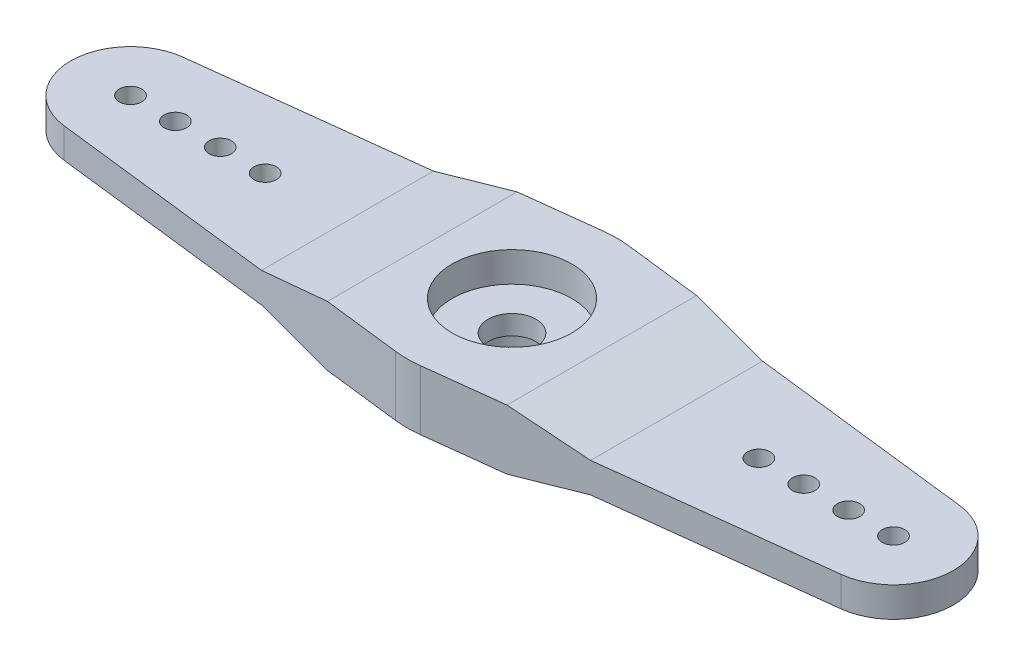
ISO-10303-21;
HEADER;
FILE_DESCRIPTION(('STEP AP214'),'2;1');
FILE_NAME('part.step','',(''),(''),'','','');
FILE_SCHEMA(('AUTOMOTIVE_DESIGN { 1 0 10303 214 1 1 1 1 }'));
ENDSEC;
DATA;
#1=APPLICATION_CONTEXT('core data for automotive mechanical design processes');
#2=APPLICATION_PROTOCOL_DEFINITION('international standard','automotive_design',2000,#1);
#3=PRODUCT_CONTEXT('',#1,'mechanical');
#4=PRODUCT('Part','Part','',(#3));
#5=PRODUCT_RELATED_PRODUCT_CATEGORY('part','',(#4));
#6=PRODUCT_DEFINITION_FORMATION('','',#4);
#7=PRODUCT_DEFINITION_CONTEXT('part definition',#1,'design');
#8=PRODUCT_DEFINITION('design','',#6,#7);
#9=PRODUCT_DEFINITION_SHAPE('','',#8);
#10=(LENGTH_UNIT() NAMED_UNIT(*) SI_UNIT(.MILLI.,.METRE.));
#11=(NAMED_UNIT(*) PLANE_ANGLE_UNIT() SI_UNIT($,.RADIAN.));
#12=(NAMED_UNIT(*) SI_UNIT($,.STERADIAN.) SOLID_ANGLE_UNIT());
#13=UNCERTAINTY_MEASURE_WITH_UNIT(LENGTH_MEASURE(1.E-05),#10,'distance_accuracy_value','');
#14=(GEOMETRIC_REPRESENTATION_CONTEXT(3) GLOBAL_UNCERTAINTY_ASSIGNED_CONTEXT((#13)) GLOBAL_UNIT_ASSIGNED_CONTEXT((#10,
#11,#12)) REPRESENTATION_CONTEXT('',''));
#15=CARTESIAN_POINT('',(0.,0.,0.));
#16=DIRECTION('',(0.,0.,1.));
#17=DIRECTION('',(1.,0.,0.));
#18=AXIS2_PLACEMENT_3D('',#15,#16,#17);
#19=CARTESIAN_POINT('',(-6.,0.,30.));
#20=DIRECTION('',(0.,1.,0.));
#21=DIRECTION('',(0.,0.,1.));
#22=AXIS2_PLACEMENT_3D('',#19,#20,#21);
#23=PLANE('',#22);
#24=DIRECTION('',(-0.993055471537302,0.,0.117647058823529));
#25=VECTOR('',#24,1.);
#26=CARTESIAN_POINT('',(-25.9705882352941,0.,11.0277781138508));
#27=LINE('',#26,#25);
#28=CARTESIAN_POINT('',(-0.823529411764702,0.,8.04861169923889));
#29=VERTEX_POINT('',#28);
#30=CARTESIAN_POINT('',(-6.,0.,8.66186700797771));
#31=VERTEX_POINT('',#30);
#32=EDGE_CURVE('E182',#29,#31,#27,.T.);
#33=ORIENTED_EDGE('',*,*,#32,.F.);
#34=CARTESIAN_POINT('',(0.,0.,15.));
#35=DIRECTION('',(0.,1.,0.));
#36=DIRECTION('',(0.,0.,1.));
#37=AXIS2_PLACEMENT_3D('',#34,#35,#36);
#38=CIRCLE('',#37,7.);
#39=CARTESIAN_POINT('',(0.823529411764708,0.,8.04861169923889));
#40=VERTEX_POINT('',#39);
#41=EDGE_CURVE('E176',#40,#29,#38,.T.);
#42=ORIENTED_EDGE('',*,*,#41,.F.);
#43=DIRECTION('',(-0.993055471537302,0.,-0.117647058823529));
#44=VECTOR('',#43,1.);
#45=CARTESIAN_POINT('',(0.823529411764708,0.,8.04861169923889));
#46=LINE('',#45,#44);
#47=CARTESIAN_POINT('',(5.99999999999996,0.,8.66186700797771));
#48=VERTEX_POINT('',#47);
#49=EDGE_CURVE('E174',#48,#40,#46,.T.);
#50=ORIENTED_EDGE('',*,*,#49,.F.);
#51=DIRECTION('',(0.,0.,-1.));
#52=VECTOR('',#51,1.);
#53=CARTESIAN_POINT('',(6.,0.,30.));
#54=LINE('',#53,#52);
#55=CARTESIAN_POINT('',(6.00000000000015,0.,21.3381329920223));
#56=VERTEX_POINT('',#55);
#57=EDGE_CURVE('E173',#56,#48,#54,.T.);
#58=ORIENTED_EDGE('',*,*,#57,.F.);
#59=DIRECTION('',(0.993055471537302,0.,-0.117647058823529));
#60=VECTOR('',#59,1.);
#61=CARTESIAN_POINT('',(25.9705882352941,0.,18.9722218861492));
#62=LINE('',#61,#60);
#63=CARTESIAN_POINT('',(0.823529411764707,0.,21.9513883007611));
#64=VERTEX_POINT('',#63);
#65=EDGE_CURVE('E151',#64,#56,#62,.T.);
#66=ORIENTED_EDGE('',*,*,#65,.F.);
#67=CARTESIAN_POINT('',(0.,0.,15.));
#68=DIRECTION('',(0.,1.,0.));
#69=DIRECTION('',(0.,0.,1.));
#70=AXIS2_PLACEMENT_3D('',#67,#68,#69);
#71=CIRCLE('',#70,7.);
#72=CARTESIAN_POINT('',(-0.823529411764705,0.,21.9513883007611));
#73=VERTEX_POINT('',#72);
#74=EDGE_CURVE('E161',#73,#64,#71,.T.);
#75=ORIENTED_EDGE('',*,*,#74,.F.);
#76=DIRECTION('',(0.993055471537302,0.,0.117647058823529));
#77=VECTOR('',#76,1.);
#78=CARTESIAN_POINT('',(-0.823529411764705,0.,21.9513883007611));
#79=LINE('',#78,#77);
#80=CARTESIAN_POINT('',(-6.,0.,21.3381329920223));
#81=VERTEX_POINT('',#80);
#82=EDGE_CURVE('E157',#81,#73,#79,.T.);
#83=ORIENTED_EDGE('',*,*,#82,.F.);
#84=DIRECTION('',(0.,0.,-1.));
#85=VECTOR('',#84,1.);
#86=CARTESIAN_POINT('',(-6.,0.,30.));
#87=LINE('',#86,#85);
#88=EDGE_CURVE('E263',#81,#31,#87,.T.);
#89=ORIENTED_EDGE('',*,*,#88,.T.);
#90=EDGE_LOOP('',(#33,#42,#50,#58,#66,#75,#83,#89));
#91=FACE_BOUND('',#90,.T.);
#92=CARTESIAN_POINT('',(0.,0.,15.));
#93=DIRECTION('',(0.,1.,0.));
#94=DIRECTION('',(0.,0.,1.));
#95=AXIS2_PLACEMENT_3D('',#92,#93,#94);
#96=CIRCLE('',#95,5.);
#97=CARTESIAN_POINT('',(0.,0.,20.));
#98=VERTEX_POINT('',#97);
#99=EDGE_CURVE('E11',#98,#98,#96,.F.);
#100=ORIENTED_EDGE('',*,*,#99,.F.);
#101=EDGE_LOOP('',(#100));
#102=FACE_BOUND('',#101,.T.);
#103=ADVANCED_FACE('F35',(#91,#102),#23,.F.);
#104=CARTESIAN_POINT('',(-30.,3.,30.));
#105=DIRECTION('',(0.,-1.,0.));
#106=DIRECTION('',(0.,0.,-1.));
#107=AXIS2_PLACEMENT_3D('',#104,#105,#106);
#108=PLANE('',#107);
#109=CARTESIAN_POINT('',(-25.5,3.,15.));
#110=DIRECTION('',(0.,1.,0.));
#111=DIRECTION('',(0.,0.,1.));
#112=AXIS2_PLACEMENT_3D('',#109,#110,#111);
#113=CIRCLE('',#112,0.750000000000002);
#114=CARTESIAN_POINT('',(-25.5,3.,15.75));
#115=VERTEX_POINT('',#114);
#116=EDGE_CURVE('E291',#115,#115,#113,.T.);
#117=ORIENTED_EDGE('',*,*,#116,.F.);
#118=EDGE_LOOP('',(#117));
#119=FACE_BOUND('',#118,.T.);
#120=CARTESIAN_POINT('',(-22.5,3.,15.));
#121=DIRECTION('',(0.,1.,0.));
#122=DIRECTION('',(0.,0.,1.));
#123=AXIS2_PLACEMENT_3D('',#120,#121,#122);
#124=CIRCLE('',#123,0.750000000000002);
#125=CARTESIAN_POINT('',(-22.5,3.,15.75));
#126=VERTEX_POINT('',#125);
#127=EDGE_CURVE('E287',#126,#126,#124,.T.);
#128=ORIENTED_EDGE('',*,*,#127,.F.);
#129=EDGE_LOOP('',(#128));
#130=FACE_BOUND('',#129,.T.);
#131=CARTESIAN_POINT('',(-19.5,3.,15.));
#132=DIRECTION('',(0.,1.,0.));
#133=DIRECTION('',(0.,0.,1.));
#134=AXIS2_PLACEMENT_3D('',#131,#132,#133);
#135=CIRCLE('',#134,0.750000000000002);
#136=CARTESIAN_POINT('',(-19.5,3.,15.75));
#137=VERTEX_POINT('',#136);
#138=EDGE_CURVE('E283',#137,#137,#135,.T.);
#139=ORIENTED_EDGE('',*,*,#138,.F.);
#140=EDGE_LOOP('',(#139));
#141=FACE_BOUND('',#140,.T.);
#142=CARTESIAN_POINT('',(-16.5,3.,15.));
#143=DIRECTION('',(0.,1.,0.));
#144=DIRECTION('',(0.,0.,1.));
#145=AXIS2_PLACEMENT_3D('',#142,#143,#144);
#146=CIRCLE('',#145,0.750000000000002);
#147=CARTESIAN_POINT('',(-16.5,3.,15.75));
#148=VERTEX_POINT('',#147);
#149=EDGE_CURVE('E279',#148,#148,#146,.T.);
#150=ORIENTED_EDGE('',*,*,#149,.F.);
#151=EDGE_LOOP('',(#150));
#152=FACE_BOUND('',#151,.T.);
#153=DIRECTION('',(-0.993055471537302,0.,-0.117647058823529));
#154=VECTOR('',#153,1.);
#155=CARTESIAN_POINT('',(-28.6558536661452,3.,18.6540990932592));
#156=LINE('',#155,#154);
#157=CARTESIAN_POINT('',(-11.,3.,20.7457841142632));
#158=VERTEX_POINT('',#157);
#159=CARTESIAN_POINT('',(-25.9705882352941,3.,18.9722218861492));
#160=VERTEX_POINT('',#159);
#161=EDGE_CURVE('E242',#158,#160,#156,.T.);
#162=ORIENTED_EDGE('',*,*,#161,.F.);
#163=DIRECTION('',(0.,0.,-1.));
#164=VECTOR('',#163,1.);
#165=CARTESIAN_POINT('',(-11.,3.,30.));
#166=LINE('',#165,#164);
#167=CARTESIAN_POINT('',(-11.,3.,9.2542158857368));
#168=VERTEX_POINT('',#167);
#169=EDGE_CURVE('E269',#158,#168,#166,.T.);
#170=ORIENTED_EDGE('',*,*,#169,.T.);
#171=DIRECTION('',(0.993055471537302,0.,-0.117647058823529));
#172=VECTOR('',#171,1.);
#173=CARTESIAN_POINT('',(-32.1607553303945,3.,11.7611258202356));
#174=LINE('',#173,#172);
#175=CARTESIAN_POINT('',(-25.9705882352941,3.,11.0277781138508));
#176=VERTEX_POINT('',#175);
#177=EDGE_CURVE('E234',#176,#168,#174,.T.);
#178=ORIENTED_EDGE('',*,*,#177,.F.);
#179=CARTESIAN_POINT('',(-25.5,3.,15.));
#180=DIRECTION('',(0.,-1.,0.));
#181=DIRECTION('',(0.,0.,-1.));
#182=AXIS2_PLACEMENT_3D('',#179,#180,#181);
#183=CIRCLE('',#182,4.);
#184=EDGE_CURVE('E248',#160,#176,#183,.T.);
#185=ORIENTED_EDGE('',*,*,#184,.F.);
#186=EDGE_LOOP('',(#162,#170,#178,#185));
#187=FACE_BOUND('',#186,.T.);
#188=ADVANCED_FACE('F348',(#119,#130,#141,#152,#187),#108,.F.);
#189=CARTESIAN_POINT('',(-6.,4.,30.));
#190=DIRECTION('',(0.,-1.,0.));
#191=DIRECTION('',(0.,0.,-1.));
#192=AXIS2_PLACEMENT_3D('',#189,#190,#191);
#193=PLANE('',#192);
#194=CARTESIAN_POINT('',(0.,4.,15.));
#195=DIRECTION('',(0.,1.,0.));
#196=DIRECTION('',(0.,0.,1.));
#197=AXIS2_PLACEMENT_3D('',#194,#195,#196);
#198=CIRCLE('',#197,4.);
#199=CARTESIAN_POINT('',(0.,4.,19.));
#200=VERTEX_POINT('',#199);
#201=EDGE_CURVE('E337',#200,#200,#198,.T.);
#202=ORIENTED_EDGE('',*,*,#201,.F.);
#203=EDGE_LOOP('',(#202));
#204=FACE_BOUND('',#203,.T.);
#205=DIRECTION('',(-0.993055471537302,0.,0.117647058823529));
#206=VECTOR('',#205,1.);
#207=CARTESIAN_POINT('',(-25.9705882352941,4.,11.0277781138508));
#208=LINE('',#207,#206);
#209=CARTESIAN_POINT('',(-0.823529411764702,4.,8.04861169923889));
#210=VERTEX_POINT('',#209);
#211=CARTESIAN_POINT('',(-6.,4.,8.66186700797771));
#212=VERTEX_POINT('',#211);
#213=EDGE_CURVE('E195',#210,#212,#208,.T.);
#214=ORIENTED_EDGE('',*,*,#213,.T.);
#215=DIRECTION('',(0.,0.,-1.));
#216=VECTOR('',#215,1.);
#217=CARTESIAN_POINT('',(-6.,4.,30.));
#218=LINE('',#217,#216);
#219=CARTESIAN_POINT('',(-6.,4.,21.3381329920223));
#220=VERTEX_POINT('',#219);
#221=EDGE_CURVE('E250',#220,#212,#218,.T.);
#222=ORIENTED_EDGE('',*,*,#221,.F.);
#223=DIRECTION('',(0.993055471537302,0.,0.117647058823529));
#224=VECTOR('',#223,1.);
#225=CARTESIAN_POINT('',(-0.823529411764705,4.,21.9513883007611));
#226=LINE('',#225,#224);
#227=CARTESIAN_POINT('',(-0.823529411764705,4.,21.9513883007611));
#228=VERTEX_POINT('',#227);
#229=EDGE_CURVE('E166',#220,#228,#226,.T.);
#230=ORIENTED_EDGE('',*,*,#229,.T.);
#231=CARTESIAN_POINT('',(0.,4.,15.));
#232=DIRECTION('',(0.,1.,0.));
#233=DIRECTION('',(0.,0.,1.));
#234=AXIS2_PLACEMENT_3D('',#231,#232,#233);
#235=CIRCLE('',#234,7.);
#236=CARTESIAN_POINT('',(0.823529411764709,4.,21.9513883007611));
#237=VERTEX_POINT('',#236);
#238=EDGE_CURVE('E185',#228,#237,#235,.T.);
#239=ORIENTED_EDGE('',*,*,#238,.T.);
#240=DIRECTION('',(0.993055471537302,0.,-0.117647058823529));
#241=VECTOR('',#240,1.);
#242=CARTESIAN_POINT('',(25.9705882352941,4.,18.9722218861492));
#243=LINE('',#242,#241);
#244=CARTESIAN_POINT('',(6.,4.,21.3381329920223));
#245=VERTEX_POINT('',#244);
#246=EDGE_CURVE('E152',#237,#245,#243,.T.);
#247=ORIENTED_EDGE('',*,*,#246,.T.);
#248=DIRECTION('',(0.,0.,-1.));
#249=VECTOR('',#248,1.);
#250=CARTESIAN_POINT('',(6.,4.,30.));
#251=LINE('',#250,#249);
#252=CARTESIAN_POINT('',(6.,4.,8.66186700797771));
#253=VERTEX_POINT('',#252);
#254=EDGE_CURVE('E253',#245,#253,#251,.T.);
#255=ORIENTED_EDGE('',*,*,#254,.T.);
#256=DIRECTION('',(-0.993055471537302,0.,-0.117647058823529));
#257=VECTOR('',#256,1.);
#258=CARTESIAN_POINT('',(0.823529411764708,4.,8.04861169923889));
#259=LINE('',#258,#257);
#260=CARTESIAN_POINT('',(0.823529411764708,4.,8.04861169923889));
#261=VERTEX_POINT('',#260);
#262=EDGE_CURVE('E189',#253,#261,#259,.T.);
#263=ORIENTED_EDGE('',*,*,#262,.T.);
#264=CARTESIAN_POINT('',(0.,4.,15.));
#265=DIRECTION('',(0.,1.,0.));
#266=DIRECTION('',(0.,0.,1.));
#267=AXIS2_PLACEMENT_3D('',#264,#265,#266);
#268=CIRCLE('',#267,7.);
#269=EDGE_CURVE('E192',#261,#210,#268,.T.);
#270=ORIENTED_EDGE('',*,*,#269,.T.);
#271=EDGE_LOOP('',(#214,#222,#230,#239,#247,#255,#263,#270));
#272=FACE_BOUND('',#271,.T.);
#273=ADVANCED_FACE('F344',(#204,#272),#193,.F.);
#274=CARTESIAN_POINT('',(6.,4.,30.));
#275=DIRECTION('',(-0.196116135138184,-0.98058067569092,0.));
#276=DIRECTION('',(0.98058067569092,-0.196116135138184,0.));
#277=AXIS2_PLACEMENT_3D('',#274,#275,#276);
#278=PLANE('',#277);
#279=DIRECTION('',(0.974030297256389,-0.194806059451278,0.115393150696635));
#280=VECTOR('',#279,1.);
#281=CARTESIAN_POINT('',(8.39832986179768,3.52033402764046,8.94599660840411));
#282=LINE('',#281,#280);
#283=CARTESIAN_POINT('',(11.,3.,9.25421588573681));
#284=VERTEX_POINT('',#283);
#285=EDGE_CURVE('E222',#253,#284,#282,.T.);
#286=ORIENTED_EDGE('',*,*,#285,.F.);
#287=ORIENTED_EDGE('',*,*,#254,.F.);
#288=DIRECTION('',(-0.974030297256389,0.194806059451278,0.115393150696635));
#289=VECTOR('',#288,1.);
#290=CARTESIAN_POINT('',(5.02643711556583,4.19471257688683,21.4534707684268));
#291=LINE('',#290,#289);
#292=CARTESIAN_POINT('',(11.,3.,20.7457841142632));
#293=VERTEX_POINT('',#292);
#294=EDGE_CURVE('E59',#293,#245,#291,.T.);
#295=ORIENTED_EDGE('',*,*,#294,.F.);
#296=DIRECTION('',(0.,0.,-1.));
#297=VECTOR('',#296,1.);
#298=CARTESIAN_POINT('',(11.,3.,30.));
#299=LINE('',#298,#297);
#300=EDGE_CURVE('E256',#293,#284,#299,.T.);
#301=ORIENTED_EDGE('',*,*,#300,.T.);
#302=EDGE_LOOP('',(#286,#287,#295,#301));
#303=FACE_BOUND('',#302,.T.);
#304=ADVANCED_FACE('F347',(#303),#278,.F.);
#305=CARTESIAN_POINT('',(11.,3.,30.));
#306=DIRECTION('',(0.,-1.,0.));
#307=DIRECTION('',(0.,0.,-1.));
#308=AXIS2_PLACEMENT_3D('',#305,#306,#307);
#309=PLANE('',#308);
#310=CARTESIAN_POINT('',(25.5,3.,15.));
#311=DIRECTION('',(0.,1.,0.));
#312=DIRECTION('',(0.,0.,1.));
#313=AXIS2_PLACEMENT_3D('',#310,#311,#312);
#314=CIRCLE('',#313,0.750000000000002);
#315=CARTESIAN_POINT('',(25.5,3.,15.75));
#316=VERTEX_POINT('',#315);
#317=EDGE_CURVE('E305',#316,#316,#314,.T.);
#318=ORIENTED_EDGE('',*,*,#317,.F.);
#319=EDGE_LOOP('',(#318));
#320=FACE_BOUND('',#319,.T.);
#321=CARTESIAN_POINT('',(22.5,3.,15.));
#322=DIRECTION('',(0.,1.,0.));
#323=DIRECTION('',(0.,0.,1.));
#324=AXIS2_PLACEMENT_3D('',#321,#322,#323);
#325=CIRCLE('',#324,0.750000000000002);
#326=CARTESIAN_POINT('',(22.5,3.,15.75));
#327=VERTEX_POINT('',#326);
#328=EDGE_CURVE('E302',#327,#327,#325,.T.);
#329=ORIENTED_EDGE('',*,*,#328,.F.);
#330=EDGE_LOOP('',(#329));
#331=FACE_BOUND('',#330,.T.);
#332=CARTESIAN_POINT('',(19.5,3.,15.));
#333=DIRECTION('',(0.,1.,0.));
#334=DIRECTION('',(0.,0.,1.));
#335=AXIS2_PLACEMENT_3D('',#332,#333,#334);
#336=CIRCLE('',#335,0.750000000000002);
#337=CARTESIAN_POINT('',(19.5,3.,15.75));
#338=VERTEX_POINT('',#337);
#339=EDGE_CURVE('E299',#338,#338,#336,.T.);
#340=ORIENTED_EDGE('',*,*,#339,.F.);
#341=EDGE_LOOP('',(#340));
#342=FACE_BOUND('',#341,.T.);
#343=CARTESIAN_POINT('',(16.5,3.,15.));
#344=DIRECTION('',(0.,1.,0.));
#345=DIRECTION('',(0.,0.,1.));
#346=AXIS2_PLACEMENT_3D('',#343,#344,#345);
#347=CIRCLE('',#346,0.750000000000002);
#348=CARTESIAN_POINT('',(16.5,3.,15.75));
#349=VERTEX_POINT('',#348);
#350=EDGE_CURVE('E295',#349,#349,#347,.T.);
#351=ORIENTED_EDGE('',*,*,#350,.F.);
#352=EDGE_LOOP('',(#351));
#353=FACE_BOUND('',#352,.T.);
#354=DIRECTION('',(0.993055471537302,0.,0.117647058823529));
#355=VECTOR('',#354,1.);
#356=CARTESIAN_POINT('',(13.4237311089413,3.,9.54135476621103));
#357=LINE('',#356,#355);
#358=CARTESIAN_POINT('',(25.9705882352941,3.,11.0277781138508));
#359=VERTEX_POINT('',#358);
#360=EDGE_CURVE('E224',#284,#359,#357,.T.);
#361=ORIENTED_EDGE('',*,*,#360,.F.);
#362=ORIENTED_EDGE('',*,*,#300,.F.);
#363=DIRECTION('',(-0.993055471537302,0.,0.117647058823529));
#364=VECTOR('',#363,1.);
#365=CARTESIAN_POINT('',(9.91882944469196,3.,20.8738701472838));
#366=LINE('',#365,#364);
#367=CARTESIAN_POINT('',(25.9705882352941,3.,18.9722218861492));
#368=VERTEX_POINT('',#367);
#369=EDGE_CURVE('E217',#368,#293,#366,.T.);
#370=ORIENTED_EDGE('',*,*,#369,.F.);
#371=CARTESIAN_POINT('',(25.5,3.,15.));
#372=DIRECTION('',(0.,-1.,0.));
#373=DIRECTION('',(0.,0.,-1.));
#374=AXIS2_PLACEMENT_3D('',#371,#372,#373);
#375=CIRCLE('',#374,4.);
#376=EDGE_CURVE('E272',#359,#368,#375,.T.);
#377=ORIENTED_EDGE('',*,*,#376,.F.);
#378=EDGE_LOOP('',(#361,#362,#370,#377));
#379=FACE_BOUND('',#378,.T.);
#380=ADVANCED_FACE('F403',(#320,#331,#342,#353,#379),#309,.F.);
#381=CARTESIAN_POINT('',(-11.,3.,30.));
#382=DIRECTION('',(0.196116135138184,-0.98058067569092,0.));
#383=DIRECTION('',(0.98058067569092,0.196116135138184,0.));
#384=AXIS2_PLACEMENT_3D('',#381,#382,#383);
#385=PLANE('',#384);
#386=DIRECTION('',(-0.974030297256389,-0.194806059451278,-0.115393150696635));
#387=VECTOR('',#386,1.);
#388=CARTESIAN_POINT('',(-9.95985921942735,3.20802815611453,20.8690093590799));
#389=LINE('',#388,#387);
#390=EDGE_CURVE('E244',#220,#158,#389,.T.);
#391=ORIENTED_EDGE('',*,*,#390,.F.);
#392=ORIENTED_EDGE('',*,*,#221,.T.);
#393=DIRECTION('',(0.974030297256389,0.194806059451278,-0.115393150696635));
#394=VECTOR('',#393,1.);
#395=CARTESIAN_POINT('',(-13.3317519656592,2.53364960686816,9.53045801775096));
#396=LINE('',#395,#394);
#397=EDGE_CURVE('E236',#168,#212,#396,.T.);
#398=ORIENTED_EDGE('',*,*,#397,.F.);
#399=ORIENTED_EDGE('',*,*,#169,.F.);
#400=EDGE_LOOP('',(#391,#392,#398,#399));
#401=FACE_BOUND('',#400,.T.);
#402=ADVANCED_FACE('F37',(#401),#385,.F.);
#403=CARTESIAN_POINT('',(-25.5,0.,15.));
#404=DIRECTION('',(0.,1.,0.));
#405=DIRECTION('',(0.,0.,1.));
#406=AXIS2_PLACEMENT_3D('',#403,#404,#405);
#407=CYLINDRICAL_SURFACE('',#406,4.);
#408=ORIENTED_EDGE('',*,*,#184,.T.);
#409=DIRECTION('',(0.,1.,0.));
#410=VECTOR('',#409,1.);
#411=CARTESIAN_POINT('',(-25.9705882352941,0.,11.0277781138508));
#412=LINE('',#411,#410);
#413=CARTESIAN_POINT('',(-25.9705882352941,1.,11.0277781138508));
#414=VERTEX_POINT('',#413);
#415=EDGE_CURVE('E204',#414,#176,#412,.T.);
#416=ORIENTED_EDGE('',*,*,#415,.F.);
#417=CARTESIAN_POINT('',(-25.5,1.,15.));
#418=DIRECTION('',(0.,1.,0.));
#419=DIRECTION('',(0.,0.,1.));
#420=AXIS2_PLACEMENT_3D('',#417,#418,#419);
#421=CIRCLE('',#420,4.);
#422=CARTESIAN_POINT('',(-25.9705882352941,1.,18.9722218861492));
#423=VERTEX_POINT('',#422);
#424=EDGE_CURVE('E44',#414,#423,#421,.T.);
#425=ORIENTED_EDGE('',*,*,#424,.T.);
#426=DIRECTION('',(0.,1.,0.));
#427=VECTOR('',#426,1.);
#428=CARTESIAN_POINT('',(-25.9705882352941,0.,18.9722218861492));
#429=LINE('',#428,#427);
#430=EDGE_CURVE('E201',#423,#160,#429,.T.);
#431=ORIENTED_EDGE('',*,*,#430,.T.);
#432=EDGE_LOOP('',(#408,#416,#425,#431));
#433=FACE_BOUND('',#432,.T.);
#434=ADVANCED_FACE('F367',(#433),#407,.T.);
#435=CARTESIAN_POINT('',(25.5,0.,15.));
#436=DIRECTION('',(0.,1.,0.));
#437=DIRECTION('',(0.,0.,1.));
#438=AXIS2_PLACEMENT_3D('',#435,#436,#437);
#439=CYLINDRICAL_SURFACE('',#438,4.);
#440=CARTESIAN_POINT('',(25.5,1.,15.));
#441=DIRECTION('',(0.,1.,0.));
#442=DIRECTION('',(0.,0.,1.));
#443=AXIS2_PLACEMENT_3D('',#440,#441,#442);
#444=CIRCLE('',#443,4.);
#445=CARTESIAN_POINT('',(25.9705882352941,1.,18.9722218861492));
#446=VERTEX_POINT('',#445);
#447=CARTESIAN_POINT('',(25.9705882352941,1.,11.0277781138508));
#448=VERTEX_POINT('',#447);
#449=EDGE_CURVE('E246',#446,#448,#444,.T.);
#450=ORIENTED_EDGE('',*,*,#449,.T.);
#451=DIRECTION('',(0.,1.,0.));
#452=VECTOR('',#451,1.);
#453=CARTESIAN_POINT('',(25.9705882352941,0.,11.0277781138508));
#454=LINE('',#453,#452);
#455=EDGE_CURVE('E211',#448,#359,#454,.T.);
#456=ORIENTED_EDGE('',*,*,#455,.T.);
#457=ORIENTED_EDGE('',*,*,#376,.T.);
#458=DIRECTION('',(0.,1.,0.));
#459=VECTOR('',#458,1.);
#460=CARTESIAN_POINT('',(25.9705882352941,0.,18.9722218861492));
#461=LINE('',#460,#459);
#462=EDGE_CURVE('E156',#446,#368,#461,.T.);
#463=ORIENTED_EDGE('',*,*,#462,.F.);
#464=EDGE_LOOP('',(#450,#456,#457,#463));
#465=FACE_BOUND('',#464,.T.);
#466=ADVANCED_FACE('F398',(#465),#439,.T.);
#467=CARTESIAN_POINT('',(-0.823529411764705,0.,21.9513883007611));
#468=DIRECTION('',(-0.117647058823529,0.,0.993055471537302));
#469=DIRECTION('',(0.993055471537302,0.,0.117647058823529));
#470=AXIS2_PLACEMENT_3D('',#467,#468,#469);
#471=PLANE('',#470);
#472=ORIENTED_EDGE('',*,*,#390,.T.);
#473=ORIENTED_EDGE('',*,*,#161,.T.);
#474=ORIENTED_EDGE('',*,*,#430,.F.);
#475=DIRECTION('',(0.993055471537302,0.,0.117647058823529));
#476=VECTOR('',#475,1.);
#477=CARTESIAN_POINT('',(-28.6558536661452,1.,18.6540990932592));
#478=LINE('',#477,#476);
#479=CARTESIAN_POINT('',(-11.,1.,20.7457841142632));
#480=VERTEX_POINT('',#479);
#481=EDGE_CURVE('E240',#423,#480,#478,.T.);
#482=ORIENTED_EDGE('',*,*,#481,.T.);
#483=DIRECTION('',(0.974030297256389,-0.194806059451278,0.115393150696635));
#484=VECTOR('',#483,1.);
#485=CARTESIAN_POINT('',(-5.02643711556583,-0.194712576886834,21.4534707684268));
#486=LINE('',#485,#484);
#487=EDGE_CURVE('E238',#480,#81,#486,.T.);
#488=ORIENTED_EDGE('',*,*,#487,.T.);
#489=ORIENTED_EDGE('',*,*,#82,.T.);
#490=DIRECTION('',(0.,1.,0.));
#491=VECTOR('',#490,1.);
#492=CARTESIAN_POINT('',(-0.823529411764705,0.,21.9513883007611));
#493=LINE('',#492,#491);
#494=EDGE_CURVE('E163',#73,#228,#493,.T.);
#495=ORIENTED_EDGE('',*,*,#494,.T.);
#496=ORIENTED_EDGE('',*,*,#229,.F.);
#497=EDGE_LOOP('',(#472,#473,#474,#482,#488,#489,#495,#496));
#498=FACE_BOUND('',#497,.T.);
#499=ADVANCED_FACE('F360',(#498),#471,.T.);
#500=CARTESIAN_POINT('',(-25.9705882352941,0.,11.0277781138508));
#501=DIRECTION('',(-0.117647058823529,0.,-0.993055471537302));
#502=DIRECTION('',(-0.993055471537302,0.,0.117647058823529));
#503=AXIS2_PLACEMENT_3D('',#500,#501,#502);
#504=PLANE('',#503);
#505=ORIENTED_EDGE('',*,*,#397,.T.);
#506=ORIENTED_EDGE('',*,*,#213,.F.);
#507=DIRECTION('',(0.,1.,0.));
#508=VECTOR('',#507,1.);
#509=CARTESIAN_POINT('',(-0.823529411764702,0.,8.04861169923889));
#510=LINE('',#509,#508);
#511=EDGE_CURVE('E207',#29,#210,#510,.T.);
#512=ORIENTED_EDGE('',*,*,#511,.F.);
#513=ORIENTED_EDGE('',*,*,#32,.T.);
#514=DIRECTION('',(-0.974030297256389,0.194806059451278,0.115393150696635));
#515=VECTOR('',#514,1.);
#516=CARTESIAN_POINT('',(-8.39832986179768,0.479665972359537,8.94599660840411));
#517=LINE('',#516,#515);
#518=CARTESIAN_POINT('',(-11.,1.,9.25421588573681));
#519=VERTEX_POINT('',#518);
#520=EDGE_CURVE('E230',#31,#519,#517,.T.);
#521=ORIENTED_EDGE('',*,*,#520,.T.);
#522=DIRECTION('',(-0.993055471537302,0.,0.117647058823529));
#523=VECTOR('',#522,1.);
#524=CARTESIAN_POINT('',(-32.1607553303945,1.,11.7611258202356));
#525=LINE('',#524,#523);
#526=EDGE_CURVE('E232',#519,#414,#525,.T.);
#527=ORIENTED_EDGE('',*,*,#526,.T.);
#528=ORIENTED_EDGE('',*,*,#415,.T.);
#529=ORIENTED_EDGE('',*,*,#177,.T.);
#530=EDGE_LOOP('',(#505,#506,#512,#513,#521,#527,#528,#529));
#531=FACE_BOUND('',#530,.T.);
#532=ADVANCED_FACE('F369',(#531),#504,.T.);
#533=CARTESIAN_POINT('',(0.823529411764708,0.,8.04861169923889));
#534=DIRECTION('',(0.117647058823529,0.,-0.993055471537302));
#535=DIRECTION('',(-0.993055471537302,0.,-0.117647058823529));
#536=AXIS2_PLACEMENT_3D('',#533,#534,#535);
#537=PLANE('',#536);
#538=DIRECTION('',(-0.974030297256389,-0.194806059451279,-0.115393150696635));
#539=VECTOR('',#538,1.);
#540=CARTESIAN_POINT('',(13.3317519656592,1.46635039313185,9.53045801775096));
#541=LINE('',#540,#539);
#542=CARTESIAN_POINT('',(11.,1.,9.2542158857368));
#543=VERTEX_POINT('',#542);
#544=EDGE_CURVE('E228',#543,#48,#541,.T.);
#545=ORIENTED_EDGE('',*,*,#544,.T.);
#546=ORIENTED_EDGE('',*,*,#49,.T.);
#547=DIRECTION('',(0.,1.,0.));
#548=VECTOR('',#547,1.);
#549=CARTESIAN_POINT('',(0.823529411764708,0.,8.04861169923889));
#550=LINE('',#549,#548);
#551=EDGE_CURVE('E209',#40,#261,#550,.T.);
#552=ORIENTED_EDGE('',*,*,#551,.T.);
#553=ORIENTED_EDGE('',*,*,#262,.F.);
#554=ORIENTED_EDGE('',*,*,#285,.T.);
#555=ORIENTED_EDGE('',*,*,#360,.T.);
#556=ORIENTED_EDGE('',*,*,#455,.F.);
#557=DIRECTION('',(-0.993055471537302,0.,-0.117647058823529));
#558=VECTOR('',#557,1.);
#559=CARTESIAN_POINT('',(13.4237311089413,1.,9.54135476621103));
#560=LINE('',#559,#558);
#561=EDGE_CURVE('E226',#448,#543,#560,.T.);
#562=ORIENTED_EDGE('',*,*,#561,.T.);
#563=EDGE_LOOP('',(#545,#546,#552,#553,#554,#555,#556,#562));
#564=FACE_BOUND('',#563,.T.);
#565=ADVANCED_FACE('F385',(#564),#537,.T.);
#566=CARTESIAN_POINT('',(25.9705882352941,0.,18.9722218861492));
#567=DIRECTION('',(0.117647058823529,0.,0.993055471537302));
#568=DIRECTION('',(0.993055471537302,0.,-0.117647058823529));
#569=AXIS2_PLACEMENT_3D('',#566,#567,#568);
#570=PLANE('',#569);
#571=DIRECTION('',(0.974030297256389,0.194806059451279,-0.115393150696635));
#572=VECTOR('',#571,1.);
#573=CARTESIAN_POINT('',(9.95985921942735,0.791971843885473,20.8690093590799));
#574=LINE('',#573,#572);
#575=CARTESIAN_POINT('',(11.,1.,20.7457841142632));
#576=VERTEX_POINT('',#575);
#577=EDGE_CURVE('E52',#56,#576,#574,.T.);
#578=ORIENTED_EDGE('',*,*,#577,.T.);
#579=DIRECTION('',(0.993055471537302,0.,-0.117647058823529));
#580=VECTOR('',#579,1.);
#581=CARTESIAN_POINT('',(9.91882944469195,1.,20.8738701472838));
#582=LINE('',#581,#580);
#583=EDGE_CURVE('E219',#576,#446,#582,.T.);
#584=ORIENTED_EDGE('',*,*,#583,.T.);
#585=ORIENTED_EDGE('',*,*,#462,.T.);
#586=ORIENTED_EDGE('',*,*,#369,.T.);
#587=ORIENTED_EDGE('',*,*,#294,.T.);
#588=ORIENTED_EDGE('',*,*,#246,.F.);
#589=DIRECTION('',(0.,1.,0.));
#590=VECTOR('',#589,1.);
#591=CARTESIAN_POINT('',(0.823529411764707,0.,21.9513883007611));
#592=LINE('',#591,#590);
#593=EDGE_CURVE('E147',#64,#237,#592,.T.);
#594=ORIENTED_EDGE('',*,*,#593,.F.);
#595=ORIENTED_EDGE('',*,*,#65,.T.);
#596=EDGE_LOOP('',(#578,#584,#585,#586,#587,#588,#594,#595));
#597=FACE_BOUND('',#596,.T.);
#598=ADVANCED_FACE('F149',(#597),#570,.T.);
#599=CARTESIAN_POINT('',(0.,0.,15.));
#600=DIRECTION('',(0.,1.,0.));
#601=DIRECTION('',(0.,0.,1.));
#602=AXIS2_PLACEMENT_3D('',#599,#600,#601);
#603=CYLINDRICAL_SURFACE('',#602,7.);
#604=ORIENTED_EDGE('',*,*,#238,.F.);
#605=ORIENTED_EDGE('',*,*,#494,.F.);
#606=ORIENTED_EDGE('',*,*,#74,.T.);
#607=ORIENTED_EDGE('',*,*,#593,.T.);
#608=EDGE_LOOP('',(#604,#605,#606,#607));
#609=FACE_BOUND('',#608,.T.);
#610=ADVANCED_FACE('F162',(#609),#603,.T.);
#611=CARTESIAN_POINT('',(0.,0.,15.));
#612=DIRECTION('',(0.,1.,0.));
#613=DIRECTION('',(0.,0.,1.));
#614=AXIS2_PLACEMENT_3D('',#611,#612,#613);
#615=CYLINDRICAL_SURFACE('',#614,7.);
#616=ORIENTED_EDGE('',*,*,#269,.F.);
#617=ORIENTED_EDGE('',*,*,#551,.F.);
#618=ORIENTED_EDGE('',*,*,#41,.T.);
#619=ORIENTED_EDGE('',*,*,#511,.T.);
#620=EDGE_LOOP('',(#616,#617,#618,#619));
#621=FACE_BOUND('',#620,.T.);
#622=ADVANCED_FACE('F383',(#621),#615,.T.);
#623=CARTESIAN_POINT('',(-30.,1.,30.));
#624=DIRECTION('',(0.,1.,0.));
#625=DIRECTION('',(0.,0.,1.));
#626=AXIS2_PLACEMENT_3D('',#623,#624,#625);
#627=PLANE('',#626);
#628=CARTESIAN_POINT('',(-25.5,1.,15.));
#629=DIRECTION('',(0.,1.,0.));
#630=DIRECTION('',(0.,0.,1.));
#631=AXIS2_PLACEMENT_3D('',#628,#629,#630);
#632=CIRCLE('',#631,0.750000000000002);
#633=CARTESIAN_POINT('',(-25.5,1.,15.75));
#634=VERTEX_POINT('',#633);
#635=EDGE_CURVE('E288',#634,#634,#632,.T.);
#636=ORIENTED_EDGE('',*,*,#635,.T.);
#637=EDGE_LOOP('',(#636));
#638=FACE_BOUND('',#637,.T.);
#639=CARTESIAN_POINT('',(-22.5,1.,15.));
#640=DIRECTION('',(0.,1.,0.));
#641=DIRECTION('',(0.,0.,1.));
#642=AXIS2_PLACEMENT_3D('',#639,#640,#641);
#643=CIRCLE('',#642,0.750000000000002);
#644=CARTESIAN_POINT('',(-22.5,1.,15.75));
#645=VERTEX_POINT('',#644);
#646=EDGE_CURVE('E284',#645,#645,#643,.T.);
#647=ORIENTED_EDGE('',*,*,#646,.T.);
#648=EDGE_LOOP('',(#647));
#649=FACE_BOUND('',#648,.T.);
#650=CARTESIAN_POINT('',(-19.5,1.,15.));
#651=DIRECTION('',(0.,1.,0.));
#652=DIRECTION('',(0.,0.,1.));
#653=AXIS2_PLACEMENT_3D('',#650,#651,#652);
#654=CIRCLE('',#653,0.750000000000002);
#655=CARTESIAN_POINT('',(-19.5,1.,15.75));
#656=VERTEX_POINT('',#655);
#657=EDGE_CURVE('E280',#656,#656,#654,.T.);
#658=ORIENTED_EDGE('',*,*,#657,.T.);
#659=EDGE_LOOP('',(#658));
#660=FACE_BOUND('',#659,.T.);
#661=CARTESIAN_POINT('',(-16.5,1.,15.));
#662=DIRECTION('',(0.,1.,0.));
#663=DIRECTION('',(0.,0.,1.));
#664=AXIS2_PLACEMENT_3D('',#661,#662,#663);
#665=CIRCLE('',#664,0.750000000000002);
#666=CARTESIAN_POINT('',(-16.5,1.,15.75));
#667=VERTEX_POINT('',#666);
#668=EDGE_CURVE('E275',#667,#667,#665,.T.);
#669=ORIENTED_EDGE('',*,*,#668,.T.);
#670=EDGE_LOOP('',(#669));
#671=FACE_BOUND('',#670,.T.);
#672=ORIENTED_EDGE('',*,*,#481,.F.);
#673=ORIENTED_EDGE('',*,*,#424,.F.);
#674=ORIENTED_EDGE('',*,*,#526,.F.);
#675=DIRECTION('',(0.,0.,-1.));
#676=VECTOR('',#675,1.);
#677=CARTESIAN_POINT('',(-11.,1.,30.));
#678=LINE('',#677,#676);
#679=EDGE_CURVE('E266',#480,#519,#678,.T.);
#680=ORIENTED_EDGE('',*,*,#679,.F.);
#681=EDGE_LOOP('',(#672,#673,#674,#680));
#682=FACE_BOUND('',#681,.T.);
#683=ADVANCED_FACE('F375',(#638,#649,#660,#671,#682),#627,.F.);
#684=CARTESIAN_POINT('',(-6.,0.,30.));
#685=DIRECTION('',(0.196116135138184,0.98058067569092,0.));
#686=DIRECTION('',(-0.98058067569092,0.196116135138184,0.));
#687=AXIS2_PLACEMENT_3D('',#684,#685,#686);
#688=PLANE('',#687);
#689=ORIENTED_EDGE('',*,*,#487,.F.);
#690=ORIENTED_EDGE('',*,*,#679,.T.);
#691=ORIENTED_EDGE('',*,*,#520,.F.);
#692=ORIENTED_EDGE('',*,*,#88,.F.);
#693=EDGE_LOOP('',(#689,#690,#691,#692));
#694=FACE_BOUND('',#693,.T.);
#695=ADVANCED_FACE('F378',(#694),#688,.F.);
#696=CARTESIAN_POINT('',(11.,1.,30.));
#697=DIRECTION('',(-0.196116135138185,0.98058067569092,0.));
#698=DIRECTION('',(-0.98058067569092,-0.196116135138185,0.));
#699=AXIS2_PLACEMENT_3D('',#696,#697,#698);
#700=PLANE('',#699);
#701=ORIENTED_EDGE('',*,*,#544,.F.);
#702=DIRECTION('',(0.,0.,-1.));
#703=VECTOR('',#702,1.);
#704=CARTESIAN_POINT('',(11.,1.,30.));
#705=LINE('',#704,#703);
#706=EDGE_CURVE('E259',#576,#543,#705,.T.);
#707=ORIENTED_EDGE('',*,*,#706,.F.);
#708=ORIENTED_EDGE('',*,*,#577,.F.);
#709=ORIENTED_EDGE('',*,*,#57,.T.);
#710=EDGE_LOOP('',(#701,#707,#708,#709));
#711=FACE_BOUND('',#710,.T.);
#712=ADVANCED_FACE('F389',(#711),#700,.F.);
#713=CARTESIAN_POINT('',(11.,1.,30.));
#714=DIRECTION('',(0.,1.,0.));
#715=DIRECTION('',(0.,0.,1.));
#716=AXIS2_PLACEMENT_3D('',#713,#714,#715);
#717=PLANE('',#716);
#718=CARTESIAN_POINT('',(25.5,1.,15.));
#719=DIRECTION('',(0.,1.,0.));
#720=DIRECTION('',(0.,0.,1.));
#721=AXIS2_PLACEMENT_3D('',#718,#719,#720);
#722=CIRCLE('',#721,0.750000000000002);
#723=CARTESIAN_POINT('',(25.5,1.,15.75));
#724=VERTEX_POINT('',#723);
#725=EDGE_CURVE('E303',#724,#724,#722,.T.);
#726=ORIENTED_EDGE('',*,*,#725,.T.);
#727=EDGE_LOOP('',(#726));
#728=FACE_BOUND('',#727,.T.);
#729=CARTESIAN_POINT('',(22.5,1.,15.));
#730=DIRECTION('',(0.,1.,0.));
#731=DIRECTION('',(0.,0.,1.));
#732=AXIS2_PLACEMENT_3D('',#729,#730,#731);
#733=CIRCLE('',#732,0.750000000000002);
#734=CARTESIAN_POINT('',(22.5,1.,15.75));
#735=VERTEX_POINT('',#734);
#736=EDGE_CURVE('E300',#735,#735,#733,.T.);
#737=ORIENTED_EDGE('',*,*,#736,.T.);
#738=EDGE_LOOP('',(#737));
#739=FACE_BOUND('',#738,.T.);
#740=CARTESIAN_POINT('',(19.5,1.,15.));
#741=DIRECTION('',(0.,1.,0.));
#742=DIRECTION('',(0.,0.,1.));
#743=AXIS2_PLACEMENT_3D('',#740,#741,#742);
#744=CIRCLE('',#743,0.750000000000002);
#745=CARTESIAN_POINT('',(19.5,1.,15.75));
#746=VERTEX_POINT('',#745);
#747=EDGE_CURVE('E296',#746,#746,#744,.T.);
#748=ORIENTED_EDGE('',*,*,#747,.T.);
#749=EDGE_LOOP('',(#748));
#750=FACE_BOUND('',#749,.T.);
#751=CARTESIAN_POINT('',(16.5,1.,15.));
#752=DIRECTION('',(0.,1.,0.));
#753=DIRECTION('',(0.,0.,1.));
#754=AXIS2_PLACEMENT_3D('',#751,#752,#753);
#755=CIRCLE('',#754,0.750000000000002);
#756=CARTESIAN_POINT('',(16.5,1.,15.75));
#757=VERTEX_POINT('',#756);
#758=EDGE_CURVE('E292',#757,#757,#755,.T.);
#759=ORIENTED_EDGE('',*,*,#758,.T.);
#760=EDGE_LOOP('',(#759));
#761=FACE_BOUND('',#760,.T.);
#762=ORIENTED_EDGE('',*,*,#561,.F.);
#763=ORIENTED_EDGE('',*,*,#449,.F.);
#764=ORIENTED_EDGE('',*,*,#583,.F.);
#765=ORIENTED_EDGE('',*,*,#706,.T.);
#766=EDGE_LOOP('',(#762,#763,#764,#765));
#767=FACE_BOUND('',#766,.T.);
#768=ADVANCED_FACE('F393',(#728,#739,#750,#761,#767),#717,.F.);
#769=CARTESIAN_POINT('',(0.,2.,15.));
#770=DIRECTION('',(0.,1.,0.));
#771=DIRECTION('',(0.,0.,1.));
#772=AXIS2_PLACEMENT_3D('',#769,#770,#771);
#773=CYLINDRICAL_SURFACE('',#772,4.);
#774=CARTESIAN_POINT('',(0.,2.,15.));
#775=DIRECTION('',(0.,1.,0.));
#776=DIRECTION('',(0.,0.,1.));
#777=AXIS2_PLACEMENT_3D('',#774,#775,#776);
#778=CIRCLE('',#777,4.);
#779=CARTESIAN_POINT('',(0.,2.,19.));
#780=VERTEX_POINT('',#779);
#781=EDGE_CURVE('E187',#780,#780,#778,.T.);
#782=ORIENTED_EDGE('',*,*,#781,.F.);
#783=EDGE_LOOP('',(#782));
#784=FACE_BOUND('',#783,.T.);
#785=ORIENTED_EDGE('',*,*,#201,.T.);
#786=EDGE_LOOP('',(#785));
#787=FACE_BOUND('',#786,.T.);
#788=ADVANCED_FACE('F342',(#784,#787),#773,.F.);
#789=CARTESIAN_POINT('',(0.,2.,15.));
#790=DIRECTION('',(0.,1.,0.));
#791=DIRECTION('',(0.,0.,1.));
#792=AXIS2_PLACEMENT_3D('',#789,#790,#791);
#793=PLANE('',#792);
#794=CARTESIAN_POINT('',(0.,2.,15.));
#795=DIRECTION('',(0.,1.,0.));
#796=DIRECTION('',(0.,0.,1.));
#797=AXIS2_PLACEMENT_3D('',#794,#795,#796);
#798=CIRCLE('',#797,1.6);
#799=CARTESIAN_POINT('',(0.,2.,16.6));
#800=VERTEX_POINT('',#799);
#801=EDGE_CURVE('E677',#800,#800,#798,.T.);
#802=ORIENTED_EDGE('',*,*,#801,.F.);
#803=EDGE_LOOP('',(#802));
#804=FACE_BOUND('',#803,.T.);
#805=ORIENTED_EDGE('',*,*,#781,.T.);
#806=EDGE_LOOP('',(#805));
#807=FACE_BOUND('',#806,.T.);
#808=ADVANCED_FACE('F463',(#804,#807),#793,.T.);
#809=CARTESIAN_POINT('',(0.,-0.5,15.));
#810=DIRECTION('',(0.,1.,0.));
#811=DIRECTION('',(0.,0.,1.));
#812=AXIS2_PLACEMENT_3D('',#809,#810,#811);
#813=CYLINDRICAL_SURFACE('',#812,5.);
#814=CARTESIAN_POINT('',(0.,-0.5,15.));
#815=DIRECTION('',(0.,-1.,0.));
#816=DIRECTION('',(0.,0.,-1.));
#817=AXIS2_PLACEMENT_3D('',#814,#815,#816);
#818=CIRCLE('',#817,5.);
#819=CARTESIAN_POINT('',(0.,-0.5,10.));
#820=VERTEX_POINT('',#819);
#821=EDGE_CURVE('E334',#820,#820,#818,.T.);
#822=ORIENTED_EDGE('',*,*,#821,.F.);
#823=EDGE_LOOP('',(#822));
#824=FACE_BOUND('',#823,.T.);
#825=ORIENTED_EDGE('',*,*,#99,.T.);
#826=EDGE_LOOP('',(#825));
#827=FACE_BOUND('',#826,.T.);
#828=ADVANCED_FACE('F459',(#824,#827),#813,.T.);
#829=CARTESIAN_POINT('',(0.,-0.5,15.));
#830=DIRECTION('',(0.,1.,0.));
#831=DIRECTION('',(0.,0.,-1.));
#832=AXIS2_PLACEMENT_3D('',#829,#830,#831);
#833=CONICAL_SURFACE('',#832,5.,0.78539816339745);
#834=CARTESIAN_POINT('',(0.,-2.,15.));
#835=DIRECTION('',(0.,-1.,0.));
#836=DIRECTION('',(0.,0.,-1.));
#837=AXIS2_PLACEMENT_3D('',#834,#835,#836);
#838=CIRCLE('',#837,3.5);
#839=CARTESIAN_POINT('',(0.,-2.,11.5));
#840=VERTEX_POINT('',#839);
#841=EDGE_CURVE('E278',#840,#840,#838,.T.);
#842=ORIENTED_EDGE('',*,*,#841,.F.);
#843=EDGE_LOOP('',(#842));
#844=FACE_BOUND('',#843,.T.);
#845=ORIENTED_EDGE('',*,*,#821,.T.);
#846=EDGE_LOOP('',(#845));
#847=FACE_BOUND('',#846,.T.);
#848=ADVANCED_FACE('F452',(#844,#847),#833,.T.);
#849=CARTESIAN_POINT('',(0.,-2.,15.));
#850=DIRECTION('',(0.,-1.,0.));
#851=DIRECTION('',(0.,0.,-1.));
#852=AXIS2_PLACEMENT_3D('',#849,#850,#851);
#853=PLANE('',#852);
#854=CARTESIAN_POINT('',(0.,-2.,15.));
#855=DIRECTION('',(0.,-1.,0.));
#856=DIRECTION('',(0.,0.,-1.));
#857=AXIS2_PLACEMENT_3D('',#854,#855,#856);
#858=CIRCLE('',#857,2.9);
#859=CARTESIAN_POINT('',(0.,-2.,12.1));
#860=VERTEX_POINT('',#859);
#861=EDGE_CURVE('E316',#860,#860,#858,.T.);
#862=ORIENTED_EDGE('',*,*,#861,.F.);
#863=EDGE_LOOP('',(#862));
#864=FACE_BOUND('',#863,.T.);
#865=ORIENTED_EDGE('',*,*,#841,.T.);
#866=EDGE_LOOP('',(#865));
#867=FACE_BOUND('',#866,.T.);
#868=ADVANCED_FACE('F442',(#864,#867),#853,.T.);
#869=CARTESIAN_POINT('',(-16.5,-2.,15.));
#870=DIRECTION('',(0.,1.,0.));
#871=DIRECTION('',(0.,0.,1.));
#872=AXIS2_PLACEMENT_3D('',#869,#870,#871);
#873=CYLINDRICAL_SURFACE('',#872,0.750000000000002);
#874=ORIENTED_EDGE('',*,*,#149,.T.);
#875=EDGE_LOOP('',(#874));
#876=FACE_BOUND('',#875,.T.);
#877=ORIENTED_EDGE('',*,*,#668,.F.);
#878=EDGE_LOOP('',(#877));
#879=FACE_BOUND('',#878,.T.);
#880=ADVANCED_FACE('F439',(#876,#879),#873,.F.);
#881=CARTESIAN_POINT('',(-19.5,-2.,15.));
#882=DIRECTION('',(0.,1.,0.));
#883=DIRECTION('',(0.,0.,1.));
#884=AXIS2_PLACEMENT_3D('',#881,#882,#883);
#885=CYLINDRICAL_SURFACE('',#884,0.750000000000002);
#886=ORIENTED_EDGE('',*,*,#138,.T.);
#887=EDGE_LOOP('',(#886));
#888=FACE_BOUND('',#887,.T.);
#889=ORIENTED_EDGE('',*,*,#657,.F.);
#890=EDGE_LOOP('',(#889));
#891=FACE_BOUND('',#890,.T.);
#892=ADVANCED_FACE('F441',(#888,#891),#885,.F.);
#893=CARTESIAN_POINT('',(-22.5,-2.,15.));
#894=DIRECTION('',(0.,1.,0.));
#895=DIRECTION('',(0.,0.,1.));
#896=AXIS2_PLACEMENT_3D('',#893,#894,#895);
#897=CYLINDRICAL_SURFACE('',#896,0.750000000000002);
#898=ORIENTED_EDGE('',*,*,#127,.T.);
#899=EDGE_LOOP('',(#898));
#900=FACE_BOUND('',#899,.T.);
#901=ORIENTED_EDGE('',*,*,#646,.F.);
#902=EDGE_LOOP('',(#901));
#903=FACE_BOUND('',#902,.T.);
#904=ADVANCED_FACE('F449',(#900,#903),#897,.F.);
#905=CARTESIAN_POINT('',(-25.5,-2.,15.));
#906=DIRECTION('',(0.,1.,0.));
#907=DIRECTION('',(0.,0.,1.));
#908=AXIS2_PLACEMENT_3D('',#905,#906,#907);
#909=CYLINDRICAL_SURFACE('',#908,0.750000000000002);
#910=ORIENTED_EDGE('',*,*,#116,.T.);
#911=EDGE_LOOP('',(#910));
#912=FACE_BOUND('',#911,.T.);
#913=ORIENTED_EDGE('',*,*,#635,.F.);
#914=EDGE_LOOP('',(#913));
#915=FACE_BOUND('',#914,.T.);
#916=ADVANCED_FACE('F580',(#912,#915),#909,.F.);
#917=CARTESIAN_POINT('',(16.5,-2.,15.));
#918=DIRECTION('',(0.,1.,0.));
#919=DIRECTION('',(0.,0.,1.));
#920=AXIS2_PLACEMENT_3D('',#917,#918,#919);
#921=CYLINDRICAL_SURFACE('',#920,0.750000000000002);
#922=ORIENTED_EDGE('',*,*,#350,.T.);
#923=EDGE_LOOP('',(#922));
#924=FACE_BOUND('',#923,.T.);
#925=ORIENTED_EDGE('',*,*,#758,.F.);
#926=EDGE_LOOP('',(#925));
#927=FACE_BOUND('',#926,.T.);
#928=ADVANCED_FACE('F589',(#924,#927),#921,.F.);
#929=CARTESIAN_POINT('',(19.5,-2.,15.));
#930=DIRECTION('',(0.,1.,0.));
#931=DIRECTION('',(0.,0.,1.));
#932=AXIS2_PLACEMENT_3D('',#929,#930,#931);
#933=CYLINDRICAL_SURFACE('',#932,0.750000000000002);
#934=ORIENTED_EDGE('',*,*,#339,.T.);
#935=EDGE_LOOP('',(#934));
#936=FACE_BOUND('',#935,.T.);
#937=ORIENTED_EDGE('',*,*,#747,.F.);
#938=EDGE_LOOP('',(#937));
#939=FACE_BOUND('',#938,.T.);
#940=ADVANCED_FACE('F599',(#936,#939),#933,.F.);
#941=CARTESIAN_POINT('',(22.5,-2.,15.));
#942=DIRECTION('',(0.,1.,0.));
#943=DIRECTION('',(0.,0.,1.));
#944=AXIS2_PLACEMENT_3D('',#941,#942,#943);
#945=CYLINDRICAL_SURFACE('',#944,0.750000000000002);
#946=ORIENTED_EDGE('',*,*,#328,.T.);
#947=EDGE_LOOP('',(#946));
#948=FACE_BOUND('',#947,.T.);
#949=ORIENTED_EDGE('',*,*,#736,.F.);
#950=EDGE_LOOP('',(#949));
#951=FACE_BOUND('',#950,.T.);
#952=ADVANCED_FACE('F609',(#948,#951),#945,.F.);
#953=CARTESIAN_POINT('',(25.5,-2.,15.));
#954=DIRECTION('',(0.,1.,0.));
#955=DIRECTION('',(0.,0.,1.));
#956=AXIS2_PLACEMENT_3D('',#953,#954,#955);
#957=CYLINDRICAL_SURFACE('',#956,0.750000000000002);
#958=ORIENTED_EDGE('',*,*,#317,.T.);
#959=EDGE_LOOP('',(#958));
#960=FACE_BOUND('',#959,.T.);
#961=ORIENTED_EDGE('',*,*,#725,.F.);
#962=EDGE_LOOP('',(#961));
#963=FACE_BOUND('',#962,.T.);
#964=ADVANCED_FACE('F619',(#960,#963),#957,.F.);
#965=CARTESIAN_POINT('',(0.,0.7,15.));
#966=DIRECTION('',(0.,-1.,0.));
#967=DIRECTION('',(0.,0.,-1.));
#968=AXIS2_PLACEMENT_3D('',#965,#966,#967);
#969=CYLINDRICAL_SURFACE('',#968,2.9);
#970=CARTESIAN_POINT('',(0.,0.7,15.));
#971=DIRECTION('',(0.,-1.,0.));
#972=DIRECTION('',(0.,0.,-1.));
#973=AXIS2_PLACEMENT_3D('',#970,#971,#972);
#974=CIRCLE('',#973,2.9);
#975=CARTESIAN_POINT('',(0.,0.7,12.1));
#976=VERTEX_POINT('',#975);
#977=EDGE_CURVE('E311',#976,#976,#974,.T.);
#978=CARTESIAN_POINT('',(0.,0.7,12.1));
#979=CARTESIAN_POINT('',(0.,0.671875,12.1));
#980=CARTESIAN_POINT('',(0.,0.64375,12.1));
#981=CARTESIAN_POINT('',(0.,0.5875,12.1));
#982=CARTESIAN_POINT('',(0.,0.559375,12.1));
#983=CARTESIAN_POINT('',(0.,0.503125,12.1));
#984=CARTESIAN_POINT('',(0.,0.475,12.1));
#985=CARTESIAN_POINT('',(0.,0.41875,12.1));
#986=CARTESIAN_POINT('',(0.,0.390625,12.1));
#987=CARTESIAN_POINT('',(0.,0.334375,12.1));
#988=CARTESIAN_POINT('',(0.,0.30625,12.1));
#989=CARTESIAN_POINT('',(0.,0.25,12.1));
#990=CARTESIAN_POINT('',(0.,0.221875,12.1));
#991=CARTESIAN_POINT('',(0.,0.165625,12.1));
#992=CARTESIAN_POINT('',(0.,0.1375,12.1));
#993=CARTESIAN_POINT('',(0.,0.0812500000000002,12.1));
#994=CARTESIAN_POINT('',(0.,0.0531250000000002,12.1));
#995=CARTESIAN_POINT('',(0.,-0.00312499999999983,12.1));
#996=CARTESIAN_POINT('',(0.,-0.0312499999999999,12.1));
#997=CARTESIAN_POINT('',(0.,-0.0874999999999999,12.1));
#998=CARTESIAN_POINT('',(0.,-0.115625,12.1));
#999=CARTESIAN_POINT('',(0.,-0.171875,12.1));
#1000=CARTESIAN_POINT('',(0.,-0.2,12.1));
#1001=CARTESIAN_POINT('',(0.,-0.25625,12.1));
#1002=CARTESIAN_POINT('',(0.,-0.284375,12.1));
#1003=CARTESIAN_POINT('',(0.,-0.340625,12.1));
#1004=CARTESIAN_POINT('',(0.,-0.36875,12.1));
#1005=CARTESIAN_POINT('',(0.,-0.425,12.1));
#1006=CARTESIAN_POINT('',(0.,-0.453125,12.1));
#1007=CARTESIAN_POINT('',(0.,-0.509375,12.1));
#1008=CARTESIAN_POINT('',(0.,-0.5375,12.1));
#1009=CARTESIAN_POINT('',(0.,-0.59375,12.1));
#1010=CARTESIAN_POINT('',(0.,-0.621875,12.1));
#1011=CARTESIAN_POINT('',(0.,-0.678125,12.1));
#1012=CARTESIAN_POINT('',(0.,-0.70625,12.1));
#1013=CARTESIAN_POINT('',(0.,-0.7625,12.1));
#1014=CARTESIAN_POINT('',(0.,-0.790625,12.1));
#1015=CARTESIAN_POINT('',(0.,-0.846875,12.1));
#1016=CARTESIAN_POINT('',(0.,-0.875,12.1));
#1017=CARTESIAN_POINT('',(0.,-0.93125,12.1));
#1018=CARTESIAN_POINT('',(0.,-0.959375,12.1));
#1019=CARTESIAN_POINT('',(0.,-1.015625,12.1));
#1020=CARTESIAN_POINT('',(0.,-1.04375,12.1));
#1021=CARTESIAN_POINT('',(0.,-1.1,12.1));
#1022=CARTESIAN_POINT('',(0.,-1.128125,12.1));
#1023=CARTESIAN_POINT('',(0.,-1.184375,12.1));
#1024=CARTESIAN_POINT('',(0.,-1.2125,12.1));
#1025=CARTESIAN_POINT('',(0.,-1.26875,12.1));
#1026=CARTESIAN_POINT('',(0.,-1.296875,12.1));
#1027=CARTESIAN_POINT('',(0.,-1.353125,12.1));
#1028=CARTESIAN_POINT('',(0.,-1.38125,12.1));
#1029=CARTESIAN_POINT('',(0.,-1.4375,12.1));
#1030=CARTESIAN_POINT('',(0.,-1.465625,12.1));
#1031=CARTESIAN_POINT('',(0.,-1.521875,12.1));
#1032=CARTESIAN_POINT('',(0.,-1.55,12.1));
#1033=CARTESIAN_POINT('',(0.,-1.60625,12.1));
#1034=CARTESIAN_POINT('',(0.,-1.634375,12.1));
#1035=CARTESIAN_POINT('',(0.,-1.690625,12.1));
#1036=CARTESIAN_POINT('',(0.,-1.71875,12.1));
#1037=CARTESIAN_POINT('',(0.,-1.775,12.1));
#1038=CARTESIAN_POINT('',(0.,-1.803125,12.1));
#1039=CARTESIAN_POINT('',(0.,-1.859375,12.1));
#1040=CARTESIAN_POINT('',(0.,-1.8875,12.1));
#1041=CARTESIAN_POINT('',(0.,-1.94375,12.1));
#1042=CARTESIAN_POINT('',(0.,-1.971875,12.1));
#1043=CARTESIAN_POINT('',(0.,-2.,12.1));
#1044=B_SPLINE_CURVE_WITH_KNOTS('',3,(#978,#979,#980,#981,#982,#983,#984,#985,#986,#987,#988,
#989,#990,#991,#992,#993,#994,#995,#996,#997,#998,#999,#1000,#1001,#1002,#1003,#1004,#1005,
#1006,#1007,#1008,#1009,#1010,#1011,#1012,#1013,#1014,#1015,#1016,#1017,#1018,#1019,#1020,#1021,
#1022,#1023,#1024,#1025,#1026,#1027,#1028,#1029,#1030,#1031,#1032,#1033,#1034,#1035,#1036,#1037,
#1038,#1039,#1040,#1041,#1042,#1043),.UNSPECIFIED.,.F.,.F.,(4,2,2,2,2,2,2,2,2,2,2,2,2,2,2,2,2,2,
2,2,2,2,2,2,2,2,2,2,2,2,2,2,4),(0.,0.0843749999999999,0.16875,0.253125,0.3375,0.421875,0.50625,
0.590625,0.675,0.759375,0.84375,0.928125,1.0125,1.096875,1.18125,1.265625,1.35,1.434375,1.51875,
1.603125,1.6875,1.771875,1.85625,1.940625,2.025,2.109375,2.19375,2.278125,2.3625,2.446875,
2.53125,2.615625,2.7),.UNSPECIFIED.);
#1045=EDGE_CURVE('BSEAM629',#976,#860,#1044,.T.);
#1046=ORIENTED_EDGE('',*,*,#977,.F.);
#1047=ORIENTED_EDGE('',*,*,#861,.T.);
#1048=ORIENTED_EDGE('',*,*,#1045,.T.);
#1049=ORIENTED_EDGE('',*,*,#1045,.F.);
#1050=EDGE_LOOP('',(#1046,#1048,#1047,#1049));
#1051=FACE_BOUND('',#1050,.T.);
#1052=ADVANCED_FACE('F629',(#1051),#969,.F.);
#1053=CARTESIAN_POINT('',(0.,0.7,15.));
#1054=DIRECTION('',(0.,-1.,0.));
#1055=DIRECTION('',(0.,0.,-1.));
#1056=AXIS2_PLACEMENT_3D('',#1053,#1054,#1055);
#1057=PLANE('',#1056);
#1058=CARTESIAN_POINT('',(0.,0.7,15.));
#1059=DIRECTION('',(0.,-1.,0.));
#1060=DIRECTION('',(0.,0.,-1.));
#1061=AXIS2_PLACEMENT_3D('',#1058,#1059,#1060);
#1062=CIRCLE('',#1061,1.6);
#1063=CARTESIAN_POINT('',(0.,0.7,13.4));
#1064=VERTEX_POINT('',#1063);
#1065=EDGE_CURVE('E39',#1064,#1064,#1062,.T.);
#1066=ORIENTED_EDGE('',*,*,#1065,.F.);
#1067=EDGE_LOOP('',(#1066));
#1068=FACE_BOUND('',#1067,.T.);
#1069=ORIENTED_EDGE('',*,*,#977,.T.);
#1070=EDGE_LOOP('',(#1069));
#1071=FACE_BOUND('',#1070,.T.);
#1072=ADVANCED_FACE('F643',(#1068,#1071),#1057,.T.);
#1073=CARTESIAN_POINT('',(0.,-2.,15.));
#1074=DIRECTION('',(0.,1.,0.));
#1075=DIRECTION('',(0.,0.,1.));
#1076=AXIS2_PLACEMENT_3D('',#1073,#1074,#1075);
#1077=CYLINDRICAL_SURFACE('',#1076,1.6);
#1078=ORIENTED_EDGE('',*,*,#1065,.T.);
#1079=EDGE_LOOP('',(#1078));
#1080=FACE_BOUND('',#1079,.T.);
#1081=ORIENTED_EDGE('',*,*,#801,.T.);
#1082=EDGE_LOOP('',(#1081));
#1083=FACE_BOUND('',#1082,.T.);
#1084=ADVANCED_FACE('F658',(#1080,#1083),#1077,.F.);
#1085=CLOSED_SHELL('',(#103,#188,#273,#304,#380,#402,#434,#466,#499,#532,#565,#598,#610,#622,
#683,#695,#712,#768,#788,#808,#828,#848,#868,#880,#892,#904,#916,#928,#940,#952,#964,#1052,
#1072,#1084));
#1086=MANIFOLD_SOLID_BREP('B2',#1085);
#1087=ADVANCED_BREP_SHAPE_REPRESENTATION('',(#18,#1086),#14);
#1088=SHAPE_DEFINITION_REPRESENTATION(#9,#1087);
ENDSEC;
END-ISO-10303-21;
